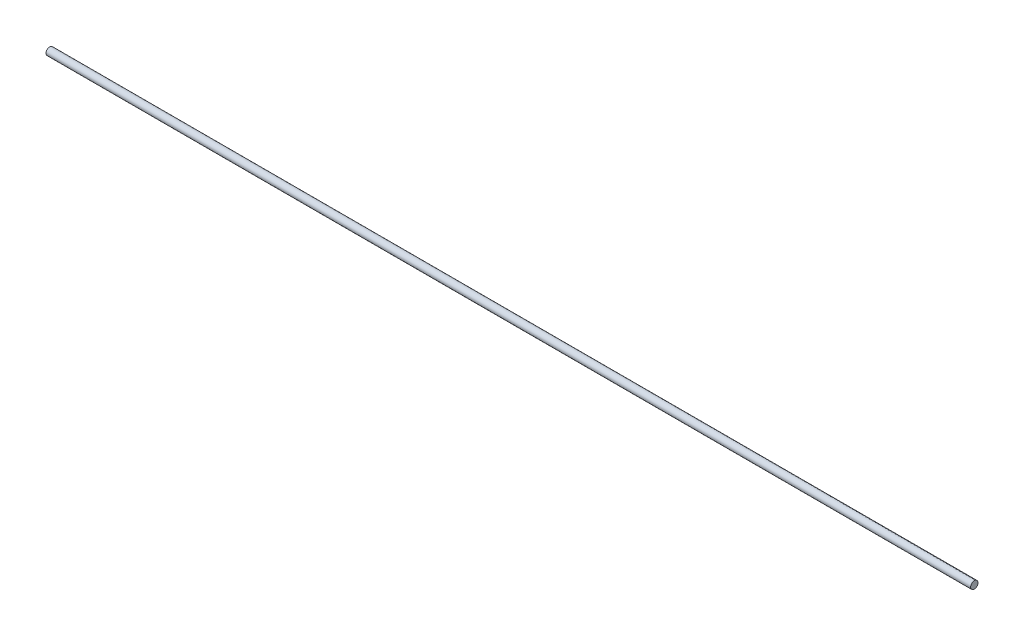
from build123d import *

# Parameters (mm, degrees)
ESQUISSE1_R      = 2
EXTRUSION1_DEPTH = 500


with BuildPart() as part:
    # Esquisse1 → Extrusion1 (new body)
    with BuildSketch(Plane(origin=(0, 0, 0), x_dir=(0, 0, -1), z_dir=(1, 0, 0))):
        Circle(ESQUISSE1_R)
    extrude(amount=EXTRUSION1_DEPTH)


solid = part.part
